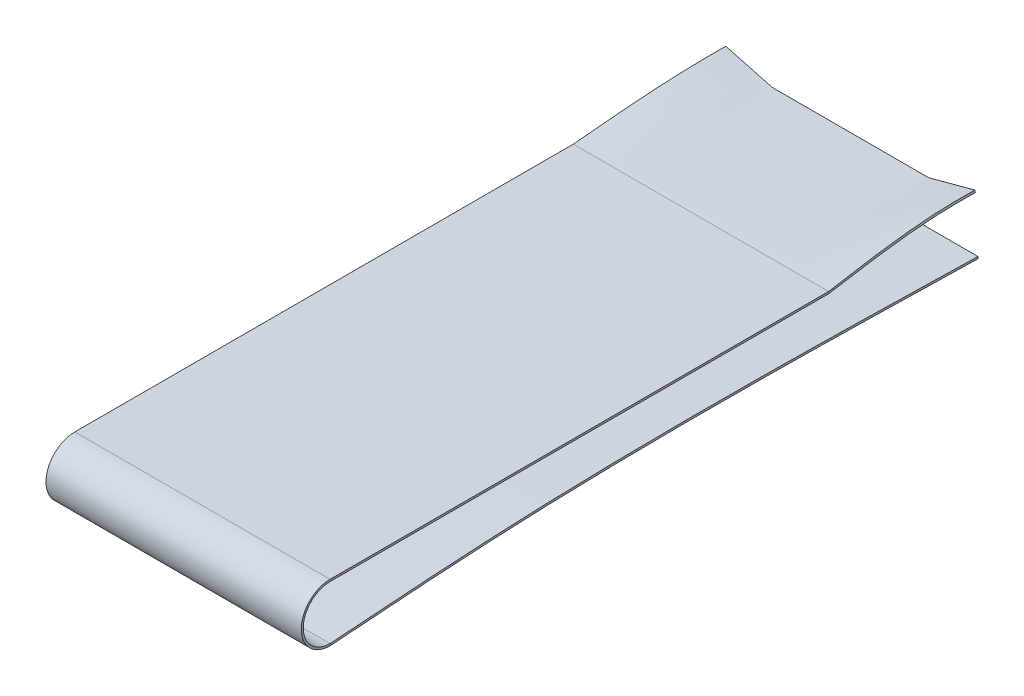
ISO-10303-21;
HEADER;
FILE_DESCRIPTION(('STEP AP214'),'2;1');
FILE_NAME('part.step','',(''),(''),'','','');
FILE_SCHEMA(('AUTOMOTIVE_DESIGN { 1 0 10303 214 1 1 1 1 }'));
ENDSEC;
DATA;
#1=APPLICATION_CONTEXT('core data for automotive mechanical design processes');
#2=APPLICATION_PROTOCOL_DEFINITION('international standard','automotive_design',2000,#1);
#3=PRODUCT_CONTEXT('',#1,'mechanical');
#4=PRODUCT('Part','Part','',(#3));
#5=PRODUCT_RELATED_PRODUCT_CATEGORY('part','',(#4));
#6=PRODUCT_DEFINITION_FORMATION('','',#4);
#7=PRODUCT_DEFINITION_CONTEXT('part definition',#1,'design');
#8=PRODUCT_DEFINITION('design','',#6,#7);
#9=PRODUCT_DEFINITION_SHAPE('','',#8);
#10=(LENGTH_UNIT() NAMED_UNIT(*) SI_UNIT(.MILLI.,.METRE.));
#11=(NAMED_UNIT(*) PLANE_ANGLE_UNIT() SI_UNIT($,.RADIAN.));
#12=(NAMED_UNIT(*) SI_UNIT($,.STERADIAN.) SOLID_ANGLE_UNIT());
#13=UNCERTAINTY_MEASURE_WITH_UNIT(LENGTH_MEASURE(1.E-05),#10,'distance_accuracy_value','');
#14=(GEOMETRIC_REPRESENTATION_CONTEXT(3) GLOBAL_UNCERTAINTY_ASSIGNED_CONTEXT((#13)) GLOBAL_UNIT_ASSIGNED_CONTEXT((#10,
#11,#12)) REPRESENTATION_CONTEXT('',''));
#15=CARTESIAN_POINT('',(0.,0.,0.));
#16=DIRECTION('',(0.,0.,1.));
#17=DIRECTION('',(1.,0.,0.));
#18=AXIS2_PLACEMENT_3D('',#15,#16,#17);
#19=CARTESIAN_POINT('',(640.,-243.675603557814,2500.));
#20=CARTESIAN_POINT('',(640.,-222.30441062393,2208.91527030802));
#21=CARTESIAN_POINT('',(640.,-142.935077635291,1127.8712260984));
#22=CARTESIAN_POINT('',(640.,-168.493221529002,43.4367961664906));
#23=CARTESIAN_POINT('',(640.,-187.169513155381,-749.));
#24=CARTESIAN_POINT('',(640.,-253.675603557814,2500.));
#25=CARTESIAN_POINT('',(640.062452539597,-232.303894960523,2208.91527030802));
#26=CARTESIAN_POINT('',(640.2943916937,-152.932646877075,1127.8712260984));
#27=CARTESIAN_POINT('',(640.219703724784,-178.49140746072,43.4367961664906));
#28=CARTESIAN_POINT('',(640.165126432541,-197.168149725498,-749.));
#29=B_SPLINE_SURFACE_WITH_KNOTS('',1,3,((#19,#20,#21,#22,#23),(#24,#25,#26,#27,#28)),
.UNSPECIFIED.,.F.,.F.,.F.,(2,2),(4,1,4),(0.,1.),(0.,0.269262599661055,1.),.UNSPECIFIED.);
#30=DIRECTION('',(0.,-1.,0.));
#31=VECTOR('',#30,1.);
#32=CARTESIAN_POINT('',(640.,-248.675603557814,2500.));
#33=LINE('',#32,#31);
#34=CARTESIAN_POINT('',(640.,-243.675603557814,2500.));
#35=VERTEX_POINT('',#34);
#36=CARTESIAN_POINT('',(640.,-253.675603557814,2500.));
#37=VERTEX_POINT('',#36);
#38=EDGE_CURVE('E13',#35,#37,#33,.T.);
#39=CARTESIAN_POINT('',(640.,-253.675603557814,2500.));
#40=CARTESIAN_POINT('',(640.062452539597,-232.303894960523,2208.91527030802));
#41=CARTESIAN_POINT('',(640.2943916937,-152.932646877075,1127.8712260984));
#42=CARTESIAN_POINT('',(640.219703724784,-178.49140746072,43.4367961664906));
#43=CARTESIAN_POINT('',(640.165126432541,-197.168149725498,-749.));
#44=B_SPLINE_CURVE_WITH_KNOTS('',3,(#39,#40,#41,#42,#43),.UNSPECIFIED.,.F.,.F.,(4,1,4),(0.,
0.269262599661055,1.),.UNSPECIFIED.);
#45=CARTESIAN_POINT('',(640.165126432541,-197.168149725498,-749.));
#46=VERTEX_POINT('',#45);
#47=EDGE_CURVE('E557',#37,#46,#44,.T.);
#48=DIRECTION('',(-0.0165126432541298,0.999863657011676,0.));
#49=VECTOR('',#48,1.);
#50=CARTESIAN_POINT('',(640.082563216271,-192.168831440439,-749.));
#51=LINE('',#50,#49);
#52=CARTESIAN_POINT('',(640.,-187.169513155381,-749.));
#53=VERTEX_POINT('',#52);
#54=EDGE_CURVE('E551',#46,#53,#51,.T.);
#55=CARTESIAN_POINT('',(640.,-243.675603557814,2500.));
#56=CARTESIAN_POINT('',(640.,-222.30441062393,2208.91527030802));
#57=CARTESIAN_POINT('',(640.,-142.935077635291,1127.8712260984));
#58=CARTESIAN_POINT('',(640.,-168.493221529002,43.4367961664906));
#59=CARTESIAN_POINT('',(640.,-187.169513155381,-749.));
#60=B_SPLINE_CURVE_WITH_KNOTS('',3,(#55,#56,#57,#58,#59),.UNSPECIFIED.,.F.,.F.,(4,1,4),(0.,
0.269262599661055,1.),.UNSPECIFIED.);
#61=EDGE_CURVE('E626',#53,#35,#60,.F.);
#62=ORIENTED_EDGE('',*,*,#38,.T.);
#63=ORIENTED_EDGE('',*,*,#47,.T.);
#64=ORIENTED_EDGE('',*,*,#54,.T.);
#65=ORIENTED_EDGE('',*,*,#61,.T.);
#66=EDGE_LOOP('',(#62,#63,#64,#65));
#67=FACE_BOUND('',#66,.T.);
#68=ADVANCED_FACE('F547',(#67),#29,.T.);
#69=CARTESIAN_POINT('',(640.,-253.675603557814,2500.));
#70=CARTESIAN_POINT('',(640.062452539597,-232.303894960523,2208.91527030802));
#71=CARTESIAN_POINT('',(640.2943916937,-152.932646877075,1127.8712260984));
#72=CARTESIAN_POINT('',(640.219703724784,-178.49140746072,43.4367961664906));
#73=CARTESIAN_POINT('',(640.165126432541,-197.168149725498,-749.));
#74=CARTESIAN_POINT('',(-640.,-253.675603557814,2500.));
#75=CARTESIAN_POINT('',(-640.,-232.303894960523,2208.91527030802));
#76=CARTESIAN_POINT('',(-640.,-152.932646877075,1127.8712260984));
#77=CARTESIAN_POINT('',(-640.,-178.49140746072,43.4367961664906));
#78=CARTESIAN_POINT('',(-640.,-197.168149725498,-749.));
#79=B_SPLINE_SURFACE_WITH_KNOTS('',1,3,((#69,#70,#71,#72,#73),(#74,#75,#76,#77,#78)),
.UNSPECIFIED.,.F.,.F.,.F.,(2,2),(4,1,4),(0.,1.),(0.,0.269262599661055,1.),.UNSPECIFIED.);
#80=DIRECTION('',(-1.,0.,0.));
#81=VECTOR('',#80,1.);
#82=CARTESIAN_POINT('',(0.,-253.675603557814,2500.));
#83=LINE('',#82,#81);
#84=CARTESIAN_POINT('',(-640.,-253.675603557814,2500.));
#85=VERTEX_POINT('',#84);
#86=EDGE_CURVE('E620',#37,#85,#83,.T.);
#87=CARTESIAN_POINT('',(-640.,-253.675603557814,2500.));
#88=CARTESIAN_POINT('',(-640.,-232.303894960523,2208.91527030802));
#89=CARTESIAN_POINT('',(-640.,-152.932646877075,1127.8712260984));
#90=CARTESIAN_POINT('',(-640.,-178.49140746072,43.4367961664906));
#91=CARTESIAN_POINT('',(-640.,-197.168149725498,-749.));
#92=B_SPLINE_CURVE_WITH_KNOTS('',3,(#87,#88,#89,#90,#91),.UNSPECIFIED.,.F.,.F.,(4,1,4),(0.,
0.269262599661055,1.),.UNSPECIFIED.);
#93=CARTESIAN_POINT('',(-640.,-197.168149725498,-749.));
#94=VERTEX_POINT('',#93);
#95=EDGE_CURVE('E592',#85,#94,#92,.T.);
#96=DIRECTION('',(1.,0.,0.));
#97=VECTOR('',#96,1.);
#98=CARTESIAN_POINT('',(0.082563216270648,-197.168149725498,-749.));
#99=LINE('',#98,#97);
#100=EDGE_CURVE('E601',#94,#46,#99,.T.);
#101=ORIENTED_EDGE('',*,*,#86,.T.);
#102=ORIENTED_EDGE('',*,*,#95,.T.);
#103=ORIENTED_EDGE('',*,*,#100,.T.);
#104=ORIENTED_EDGE('',*,*,#47,.F.);
#105=EDGE_LOOP('',(#101,#102,#103,#104));
#106=FACE_BOUND('',#105,.T.);
#107=ADVANCED_FACE('F661',(#106),#79,.T.);
#108=CARTESIAN_POINT('',(-640.,-243.675603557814,2500.));
#109=CARTESIAN_POINT('',(-640.,-222.30441062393,2208.91527030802));
#110=CARTESIAN_POINT('',(-640.,-142.935077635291,1127.8712260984));
#111=CARTESIAN_POINT('',(-640.,-168.493221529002,43.4367961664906));
#112=CARTESIAN_POINT('',(-640.,-187.169513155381,-749.));
#113=CARTESIAN_POINT('',(640.,-243.675603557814,2500.));
#114=CARTESIAN_POINT('',(640.,-222.30441062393,2208.91527030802));
#115=CARTESIAN_POINT('',(640.,-142.935077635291,1127.8712260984));
#116=CARTESIAN_POINT('',(640.,-168.493221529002,43.4367961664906));
#117=CARTESIAN_POINT('',(640.,-187.169513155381,-749.));
#118=B_SPLINE_SURFACE_WITH_KNOTS('',1,3,((#108,#109,#110,#111,#112),(#113,#114,#115,#116,#117)),
.UNSPECIFIED.,.F.,.F.,.F.,(2,2),(4,1,4),(0.,1.),(0.,0.269262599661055,1.),.UNSPECIFIED.);
#119=DIRECTION('',(1.,0.,0.));
#120=VECTOR('',#119,1.);
#121=CARTESIAN_POINT('',(0.,-243.675603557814,2500.));
#122=LINE('',#121,#120);
#123=CARTESIAN_POINT('',(-640.,-243.675603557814,2500.));
#124=VERTEX_POINT('',#123);
#125=EDGE_CURVE('E597',#124,#35,#122,.T.);
#126=DIRECTION('',(-1.,0.,0.));
#127=VECTOR('',#126,1.);
#128=CARTESIAN_POINT('',(0.,-187.169513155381,-749.));
#129=LINE('',#128,#127);
#130=CARTESIAN_POINT('',(-640.,-187.169513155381,-749.));
#131=VERTEX_POINT('',#130);
#132=EDGE_CURVE('E594',#53,#131,#129,.T.);
#133=CARTESIAN_POINT('',(-640.,-243.675603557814,2500.));
#134=CARTESIAN_POINT('',(-640.,-222.30441062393,2208.91527030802));
#135=CARTESIAN_POINT('',(-640.,-142.935077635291,1127.8712260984));
#136=CARTESIAN_POINT('',(-640.,-168.493221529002,43.4367961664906));
#137=CARTESIAN_POINT('',(-640.,-187.169513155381,-749.));
#138=B_SPLINE_CURVE_WITH_KNOTS('',3,(#133,#134,#135,#136,#137),.UNSPECIFIED.,.F.,.F.,(4,1,4),
(0.,0.269262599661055,1.),.UNSPECIFIED.);
#139=EDGE_CURVE('E590',#124,#131,#138,.T.);
#140=ORIENTED_EDGE('',*,*,#125,.T.);
#141=ORIENTED_EDGE('',*,*,#61,.F.);
#142=ORIENTED_EDGE('',*,*,#132,.T.);
#143=ORIENTED_EDGE('',*,*,#139,.F.);
#144=EDGE_LOOP('',(#140,#141,#142,#143));
#145=FACE_BOUND('',#144,.T.);
#146=ADVANCED_FACE('F603',(#145),#118,.T.);
#147=CARTESIAN_POINT('',(-640.,-253.675603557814,2500.));
#148=DIRECTION('',(-1.,0.,0.));
#149=DIRECTION('',(0.,1.,0.));
#150=AXIS2_PLACEMENT_3D('',#147,#148,#149);
#151=PLANE('',#150);
#152=DIRECTION('',(0.,1.,0.));
#153=VECTOR('',#152,1.);
#154=CARTESIAN_POINT('',(-640.,-248.675603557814,2500.));
#155=LINE('',#154,#153);
#156=EDGE_CURVE('E585',#85,#124,#155,.T.);
#157=ORIENTED_EDGE('',*,*,#156,.T.);
#158=ORIENTED_EDGE('',*,*,#139,.T.);
#159=DIRECTION('',(0.,-1.,0.));
#160=VECTOR('',#159,1.);
#161=CARTESIAN_POINT('',(-640.,-192.168831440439,-749.));
#162=LINE('',#161,#160);
#163=EDGE_CURVE('E605',#131,#94,#162,.T.);
#164=ORIENTED_EDGE('',*,*,#163,.T.);
#165=ORIENTED_EDGE('',*,*,#95,.F.);
#166=EDGE_LOOP('',(#157,#158,#164,#165));
#167=FACE_BOUND('',#166,.T.);
#168=ADVANCED_FACE('F587',(#167),#151,.T.);
#169=OPEN_SHELL('',(#68,#107,#146,#168));
#170=SHELL_BASED_SURFACE_MODEL('B2',(#169));
#171=CARTESIAN_POINT('',(640.,25.3243964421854,0.));
#172=CARTESIAN_POINT('',(633.862811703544,52.9508621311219,-207.881763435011));
#173=CARTESIAN_POINT('',(626.497893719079,86.1039355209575,-457.349771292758));
#174=CARTESIAN_POINT('',(626.931215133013,84.15334534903,-707.328601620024));
#175=CARTESIAN_POINT('',(627.003449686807,83.8281825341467,-749.));
#176=CARTESIAN_POINT('',(561.092534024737,25.3243964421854,0.));
#177=CARTESIAN_POINT('',(556.500032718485,43.3805911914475,-207.881763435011));
#178=CARTESIAN_POINT('',(550.988812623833,65.0488840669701,-457.349771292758));
#179=CARTESIAN_POINT('',(551.313070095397,63.7740110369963,-707.328601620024));
#180=CARTESIAN_POINT('',(551.367123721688,63.5614900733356,-749.000000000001));
#181=CARTESIAN_POINT('',(482.177140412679,25.3243964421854,0.));
#182=CARTESIAN_POINT('',(479.134860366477,33.8108000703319,-207.881763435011));
#183=CARTESIAN_POINT('',(475.483979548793,43.9948882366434,-457.349771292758));
#184=CARTESIAN_POINT('',(475.698782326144,43.3956984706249,-707.328601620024));
#185=CARTESIAN_POINT('',(475.734589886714,43.2958137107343,-749.));
#186=CARTESIAN_POINT('',(400.625946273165,25.3243964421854,0.));
#187=CARTESIAN_POINT('',(399.174545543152,23.9183951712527,-207.881763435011));
#188=CARTESIAN_POINT('',(397.432795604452,22.2311267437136,-457.349771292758));
#189=CARTESIAN_POINT('',(397.53527299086,22.3303986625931,-707.328601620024));
#190=CARTESIAN_POINT('',(397.552355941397,22.3469472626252,-749.));
#191=CARTESIAN_POINT('',(396.248180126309,25.3243964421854,0.));
#192=CARTESIAN_POINT('',(394.830071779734,23.5423915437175,-207.881763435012));
#193=CARTESIAN_POINT('',(393.128274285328,21.4039008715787,-457.34977129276));
#194=CARTESIAN_POINT('',(393.228401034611,21.5297208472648,-707.328601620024));
#195=CARTESIAN_POINT('',(393.245092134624,21.5506950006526,-749.));
#196=CARTESIAN_POINT('',(391.865238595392,25.3243964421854,0.));
#197=CARTESIAN_POINT('',(390.456065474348,23.4355295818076,-207.881763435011));
#198=CARTESIAN_POINT('',(388.764990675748,21.1687994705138,-457.349771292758));
#199=CARTESIAN_POINT('',(388.86448654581,21.3021645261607,-707.328601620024));
#200=CARTESIAN_POINT('',(388.881072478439,21.3243964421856,-749.));
#201=CARTESIAN_POINT('',(130.244393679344,25.3243964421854,0.));
#202=CARTESIAN_POINT('',(129.773453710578,23.4355295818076,-207.881763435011));
#203=CARTESIAN_POINT('',(129.2083033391,21.1687994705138,-457.349771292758));
#204=CARTESIAN_POINT('',(129.241554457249,21.3021645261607,-707.328601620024));
#205=CARTESIAN_POINT('',(129.247097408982,21.3243964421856,-749.000000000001));
#206=CARTESIAN_POINT('',(-129.660375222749,25.3243964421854,0.));
#207=CARTESIAN_POINT('',(-129.181888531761,23.4355295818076,-207.881763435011));
#208=CARTESIAN_POINT('',(-128.607681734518,21.1687994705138,-457.349771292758));
#209=CARTESIAN_POINT('',(-128.641465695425,21.3021645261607,-707.328601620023));
#210=CARTESIAN_POINT('',(-128.647097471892,21.3243964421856,-749.));
#211=CARTESIAN_POINT('',(-391.976531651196,25.3243964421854,0.));
#212=CARTESIAN_POINT('',(-390.557316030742,23.4355295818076,-207.881763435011));
#213=CARTESIAN_POINT('',(-388.854189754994,21.1687994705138,-457.349771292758));
#214=CARTESIAN_POINT('',(-388.954394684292,21.3021645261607,-707.328601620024));
#215=CARTESIAN_POINT('',(-388.971098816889,21.3243964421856,-749.));
#216=CARTESIAN_POINT('',(-396.355614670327,25.3243964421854,0.));
#217=CARTESIAN_POINT('',(-394.9301998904,23.5853676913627,-207.881763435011));
#218=CARTESIAN_POINT('',(-393.219634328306,21.4984504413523,-457.349771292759));
#219=CARTESIAN_POINT('',(-393.320276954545,21.6212360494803,-707.328601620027));
#220=CARTESIAN_POINT('',(-393.337054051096,21.6417043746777,-749.000000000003));
#221=CARTESIAN_POINT('',(-400.73719116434,25.3243964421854,0.));
#222=CARTESIAN_POINT('',(-399.264678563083,24.0027321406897,-207.881763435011));
#223=CARTESIAN_POINT('',(-397.497593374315,22.4166720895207,-457.349771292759));
#224=CARTESIAN_POINT('',(-397.601561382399,22.5099893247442,-707.328601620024));
#225=CARTESIAN_POINT('',(-397.618892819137,22.5255452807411,-749.));
#226=CARTESIAN_POINT('',(-481.787793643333,25.3243964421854,0.));
#227=CARTESIAN_POINT('',(-478.73308986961,33.8341251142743,-207.881763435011));
#228=CARTESIAN_POINT('',(-475.067299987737,44.0462044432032,-457.349771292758));
#229=CARTESIAN_POINT('',(-475.282979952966,43.445367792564,-707.328601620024));
#230=CARTESIAN_POINT('',(-475.318933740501,43.3452084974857,-749.));
#231=CARTESIAN_POINT('',(-560.897861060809,25.3243964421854,0.));
#232=CARTESIAN_POINT('',(-556.2909153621,43.4280068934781,-207.881763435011));
#233=CARTESIAN_POINT('',(-550.762361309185,65.153200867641,-457.349771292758));
#234=CARTESIAN_POINT('',(-551.087638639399,63.8749800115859,-707.328601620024));
#235=CARTESIAN_POINT('',(-551.141862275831,63.6619009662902,-749.));
#236=CARTESIAN_POINT('',(-640.,25.3243964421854,0.));
#237=CARTESIAN_POINT('',(-633.843832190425,53.0216946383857,-207.881763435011));
#238=CARTESIAN_POINT('',(-626.456137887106,86.2597704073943,-457.349771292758));
#239=CARTESIAN_POINT('',(-626.890799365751,84.30417904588,-707.328601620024));
#240=CARTESIAN_POINT('',(-626.963257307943,83.9781825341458,-749.));
#241=B_SPLINE_SURFACE_WITH_KNOTS('',3,3,((#171,#172,#173,#174,#175),(#176,#177,#178,#179,#180),
(#181,#182,#183,#184,#185),(#186,#187,#188,#189,#190),(#191,#192,#193,#194,#195),(#196,#197,
#198,#199,#200),(#201,#202,#203,#204,#205),(#206,#207,#208,#209,#210),(#211,#212,#213,#214,
#215),(#216,#217,#218,#219,#220),(#221,#222,#223,#224,#225),(#226,#227,#228,#229,#230),(#231,
#232,#233,#234,#235),(#236,#237,#238,#239,#240)),.UNSPECIFIED.,.F.,.F.,.F.,(4,2,1,2,2,1,2,4),(4,
1,4),(0.,0.184932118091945,0.191147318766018,0.195227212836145,0.804316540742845,
0.810026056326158,0.814611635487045,1.),(0.,0.83330029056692,1.),.UNSPECIFIED.);
#242=DIRECTION('',(-1.,0.,0.));
#243=VECTOR('',#242,1.);
#244=CARTESIAN_POINT('',(-4.69342560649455E-06,25.3243964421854,0.));
#245=LINE('',#244,#243);
#246=CARTESIAN_POINT('',(640.,25.3243964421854,0.));
#247=VERTEX_POINT('',#246);
#248=CARTESIAN_POINT('',(-640.,25.3243964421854,0.));
#249=VERTEX_POINT('',#248);
#250=EDGE_CURVE('E545',#247,#249,#245,.T.);
#251=CARTESIAN_POINT('',(-640.,25.3243964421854,0.));
#252=CARTESIAN_POINT('',(-633.843832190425,53.0216946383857,-207.881763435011));
#253=CARTESIAN_POINT('',(-626.456137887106,86.2597704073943,-457.349771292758));
#254=CARTESIAN_POINT('',(-626.890799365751,84.30417904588,-707.328601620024));
#255=CARTESIAN_POINT('',(-626.963257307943,83.9781825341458,-749.));
#256=B_SPLINE_CURVE_WITH_KNOTS('',3,(#251,#252,#253,#254,#255),.UNSPECIFIED.,.F.,.F.,(4,1,4),
(0.,0.83330029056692,1.),.UNSPECIFIED.);
#257=CARTESIAN_POINT('',(-626.963257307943,83.9781825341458,-749.));
#258=VERTEX_POINT('',#257);
#259=EDGE_CURVE('E731',#249,#258,#256,.T.);
#260=CARTESIAN_POINT('',(627.003449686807,83.8281825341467,-749.));
#261=CARTESIAN_POINT('',(551.367123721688,63.5614900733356,-749.000000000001));
#262=CARTESIAN_POINT('',(475.734589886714,43.2958137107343,-749.));
#263=CARTESIAN_POINT('',(397.552355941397,22.3469472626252,-749.));
#264=CARTESIAN_POINT('',(393.245092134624,21.5506950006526,-749.));
#265=CARTESIAN_POINT('',(388.881072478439,21.3243964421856,-749.));
#266=CARTESIAN_POINT('',(129.247097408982,21.3243964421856,-749.000000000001));
#267=CARTESIAN_POINT('',(-128.647097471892,21.3243964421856,-749.));
#268=CARTESIAN_POINT('',(-388.971098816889,21.3243964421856,-749.));
#269=CARTESIAN_POINT('',(-393.337054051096,21.6417043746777,-749.000000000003));
#270=CARTESIAN_POINT('',(-397.618892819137,22.5255452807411,-749.));
#271=CARTESIAN_POINT('',(-475.318933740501,43.3452084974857,-749.));
#272=CARTESIAN_POINT('',(-551.141862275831,63.6619009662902,-749.));
#273=CARTESIAN_POINT('',(-626.963257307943,83.9781825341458,-749.));
#274=B_SPLINE_CURVE_WITH_KNOTS('',3,(#260,#261,#262,#263,#264,#265,#266,#267,#268,#269,#270,
#271,#272,#273),.UNSPECIFIED.,.F.,.F.,(4,2,1,2,2,1,2,4),(0.,0.184932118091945,0.191147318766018,
0.195227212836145,0.804316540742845,0.810026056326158,0.814611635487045,1.),.UNSPECIFIED.);
#275=CARTESIAN_POINT('',(627.003449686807,83.8281825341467,-749.));
#276=VERTEX_POINT('',#275);
#277=EDGE_CURVE('E738',#258,#276,#274,.F.);
#278=CARTESIAN_POINT('',(640.,25.3243964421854,0.));
#279=CARTESIAN_POINT('',(633.862811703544,52.9508621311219,-207.881763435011));
#280=CARTESIAN_POINT('',(626.497893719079,86.1039355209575,-457.349771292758));
#281=CARTESIAN_POINT('',(626.931215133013,84.15334534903,-707.328601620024));
#282=CARTESIAN_POINT('',(627.003449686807,83.8281825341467,-749.));
#283=B_SPLINE_CURVE_WITH_KNOTS('',3,(#278,#279,#280,#281,#282),.UNSPECIFIED.,.F.,.F.,(4,1,4),
(0.,0.83330029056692,1.),.UNSPECIFIED.);
#284=EDGE_CURVE('E806',#276,#247,#283,.F.);
#285=ORIENTED_EDGE('',*,*,#250,.T.);
#286=ORIENTED_EDGE('',*,*,#259,.T.);
#287=ORIENTED_EDGE('',*,*,#277,.T.);
#288=ORIENTED_EDGE('',*,*,#284,.T.);
#289=EDGE_LOOP('',(#285,#286,#287,#288));
#290=FACE_BOUND('',#289,.T.);
#291=ADVANCED_FACE('F722',(#290),#241,.T.);
#292=CARTESIAN_POINT('',(-640.,25.3243964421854,0.));
#293=CARTESIAN_POINT('',(-633.843832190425,53.0216946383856,-207.881763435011));
#294=CARTESIAN_POINT('',(-626.456137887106,86.2597704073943,-457.349771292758));
#295=CARTESIAN_POINT('',(-626.890799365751,84.3041790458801,-707.328601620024));
#296=CARTESIAN_POINT('',(-626.963257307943,83.9781825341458,-749.));
#297=CARTESIAN_POINT('',(-640.,35.3243964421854,0.));
#298=CARTESIAN_POINT('',(-632.621645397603,62.8607906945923,-207.881763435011));
#299=CARTESIAN_POINT('',(-623.767268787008,95.9057740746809,-457.349771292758));
#300=CARTESIAN_POINT('',(-624.288223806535,93.9615434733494,-707.328601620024));
#301=CARTESIAN_POINT('',(-624.375066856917,93.6374407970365,-749.));
#302=B_SPLINE_SURFACE_WITH_KNOTS('',1,3,((#292,#293,#294,#295,#296),(#297,#298,#299,#300,#301)),
.UNSPECIFIED.,.F.,.F.,.F.,(2,2),(4,1,4),(0.,1.),(0.,0.83330029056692,1.),.UNSPECIFIED.);
#303=DIRECTION('',(0.,1.,0.));
#304=VECTOR('',#303,1.);
#305=CARTESIAN_POINT('',(-640.,30.3243964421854,0.));
#306=LINE('',#305,#304);
#307=CARTESIAN_POINT('',(-640.,35.3243964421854,0.));
#308=VERTEX_POINT('',#307);
#309=EDGE_CURVE('E800',#249,#308,#306,.T.);
#310=CARTESIAN_POINT('',(-640.,35.3243964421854,0.));
#311=CARTESIAN_POINT('',(-632.621645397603,62.8607906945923,-207.881763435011));
#312=CARTESIAN_POINT('',(-623.767268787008,95.9057740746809,-457.349771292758));
#313=CARTESIAN_POINT('',(-624.288223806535,93.9615434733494,-707.328601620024));
#314=CARTESIAN_POINT('',(-624.375066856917,93.6374407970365,-749.));
#315=B_SPLINE_CURVE_WITH_KNOTS('',3,(#310,#311,#312,#313,#314),.UNSPECIFIED.,.F.,.F.,(4,1,4),
(0.,0.83330029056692,1.),.UNSPECIFIED.);
#316=CARTESIAN_POINT('',(-624.375066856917,93.6374407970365,-749.));
#317=VERTEX_POINT('',#316);
#318=EDGE_CURVE('E767',#308,#317,#315,.T.);
#319=DIRECTION('',(-0.258819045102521,-0.965925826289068,0.));
#320=VECTOR('',#319,1.);
#321=CARTESIAN_POINT('',(-625.66916208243,88.8078116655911,-749.));
#322=LINE('',#321,#320);
#323=EDGE_CURVE('E776',#317,#258,#322,.T.);
#324=ORIENTED_EDGE('',*,*,#309,.T.);
#325=ORIENTED_EDGE('',*,*,#318,.T.);
#326=ORIENTED_EDGE('',*,*,#323,.T.);
#327=ORIENTED_EDGE('',*,*,#259,.F.);
#328=EDGE_LOOP('',(#324,#325,#326,#327));
#329=FACE_BOUND('',#328,.T.);
#330=ADVANCED_FACE('F830',(#329),#302,.T.);
#331=CARTESIAN_POINT('',(640.,35.3243964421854,0.));
#332=CARTESIAN_POINT('',(632.640624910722,62.7899581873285,-207.881763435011));
#333=CARTESIAN_POINT('',(623.809024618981,95.7499391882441,-457.349771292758));
#334=CARTESIAN_POINT('',(624.328639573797,93.8107097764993,-707.328601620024));
#335=CARTESIAN_POINT('',(624.415259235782,93.4874407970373,-749.));
#336=CARTESIAN_POINT('',(640.,25.3243964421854,0.));
#337=CARTESIAN_POINT('',(633.862811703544,52.9508621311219,-207.881763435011));
#338=CARTESIAN_POINT('',(626.497893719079,86.1039355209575,-457.349771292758));
#339=CARTESIAN_POINT('',(626.931215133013,84.15334534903,-707.328601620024));
#340=CARTESIAN_POINT('',(627.003449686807,83.8281825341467,-749.));
#341=B_SPLINE_SURFACE_WITH_KNOTS('',1,3,((#331,#332,#333,#334,#335),(#336,#337,#338,#339,#340)),
.UNSPECIFIED.,.F.,.F.,.F.,(2,2),(4,1,4),(0.,1.),(0.,0.83330029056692,1.),.UNSPECIFIED.);
#342=DIRECTION('',(0.,-1.,0.));
#343=VECTOR('',#342,1.);
#344=CARTESIAN_POINT('',(640.,30.3243964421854,0.));
#345=LINE('',#344,#343);
#346=CARTESIAN_POINT('',(640.,35.3243964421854,0.));
#347=VERTEX_POINT('',#346);
#348=EDGE_CURVE('E772',#347,#247,#345,.T.);
#349=DIRECTION('',(-0.258819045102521,0.965925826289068,0.));
#350=VECTOR('',#349,1.);
#351=CARTESIAN_POINT('',(625.709354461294,88.657811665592,-749.));
#352=LINE('',#351,#350);
#353=CARTESIAN_POINT('',(624.415259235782,93.4874407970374,-749.));
#354=VERTEX_POINT('',#353);
#355=EDGE_CURVE('E769',#276,#354,#352,.T.);
#356=CARTESIAN_POINT('',(640.,35.3243964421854,0.));
#357=CARTESIAN_POINT('',(632.640624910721,62.7899581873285,-207.881763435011));
#358=CARTESIAN_POINT('',(623.809024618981,95.7499391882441,-457.349771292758));
#359=CARTESIAN_POINT('',(624.328639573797,93.8107097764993,-707.328601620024));
#360=CARTESIAN_POINT('',(624.415259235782,93.4874407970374,-749.));
#361=B_SPLINE_CURVE_WITH_KNOTS('',3,(#356,#357,#358,#359,#360),.UNSPECIFIED.,.F.,.F.,(4,1,4),
(0.,0.83330029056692,1.),.UNSPECIFIED.);
#362=EDGE_CURVE('E765',#347,#354,#361,.T.);
#363=ORIENTED_EDGE('',*,*,#348,.T.);
#364=ORIENTED_EDGE('',*,*,#284,.F.);
#365=ORIENTED_EDGE('',*,*,#355,.T.);
#366=ORIENTED_EDGE('',*,*,#362,.F.);
#367=EDGE_LOOP('',(#363,#364,#365,#366));
#368=FACE_BOUND('',#367,.T.);
#369=ADVANCED_FACE('F778',(#368),#341,.T.);
#370=CARTESIAN_POINT('',(-640.,35.3243964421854,0.));
#371=CARTESIAN_POINT('',(-632.621645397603,62.8607906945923,-207.881763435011));
#372=CARTESIAN_POINT('',(-623.767268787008,95.9057740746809,-457.349771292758));
#373=CARTESIAN_POINT('',(-624.288223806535,93.9615434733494,-707.328601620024));
#374=CARTESIAN_POINT('',(-624.375066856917,93.6374407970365,-749.));
#375=CARTESIAN_POINT('',(-561.012614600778,35.3243964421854,0.));
#376=CARTESIAN_POINT('',(-555.329806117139,53.3208301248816,-207.881763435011));
#377=CARTESIAN_POINT('',(-548.510165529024,74.9174068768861,-457.349771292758));
#378=CARTESIAN_POINT('',(-548.911405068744,73.6467533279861,-707.328601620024));
#379=CARTESIAN_POINT('',(-548.978291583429,73.4349357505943,-749.));
#380=CARTESIAN_POINT('',(-482.017280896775,35.3243964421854,0.));
#381=CARTESIAN_POINT('',(-478.032702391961,43.780582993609,-207.881763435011));
#382=CARTESIAN_POINT('',(-473.25101858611,53.9284092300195,-457.349771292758));
#383=CARTESIAN_POINT('',(-473.532353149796,53.3313529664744,-707.328601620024));
#384=CARTESIAN_POINT('',(-473.579251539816,53.2318238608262,-749.));
#385=CARTESIAN_POINT('',(-400.375157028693,35.3243964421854,0.));
#386=CARTESIAN_POINT('',(-398.137171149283,33.9183960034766,-207.881763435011));
#387=CARTESIAN_POINT('',(-395.451481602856,32.2311285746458,-457.349771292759));
#388=CARTESIAN_POINT('',(-395.609496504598,32.3304004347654,-707.328601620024));
#389=CARTESIAN_POINT('',(-395.635837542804,32.3469490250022,-749.));
#390=CARTESIAN_POINT('',(-395.979156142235,35.3243964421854,0.));
#391=CARTESIAN_POINT('',(-393.783069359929,33.5423912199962,-207.881763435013));
#392=CARTESIAN_POINT('',(-391.14766072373,31.4039001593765,-457.349771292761));
#393=CARTESIAN_POINT('',(-391.302717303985,31.5297201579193,-707.328601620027));
#394=CARTESIAN_POINT('',(-391.32856519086,31.5506943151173,-749.000000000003));
#395=CARTESIAN_POINT('',(-391.577965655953,35.3243964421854,0.));
#396=CARTESIAN_POINT('',(-389.399430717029,33.4355295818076,-207.881763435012));
#397=CARTESIAN_POINT('',(-386.785085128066,31.1687994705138,-457.349771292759));
#398=CARTESIAN_POINT('',(-386.93890244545,31.3021645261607,-707.328601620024));
#399=CARTESIAN_POINT('',(-386.964543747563,31.3243964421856,-749.));
#400=CARTESIAN_POINT('',(-129.756088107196,35.3243964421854,0.));
#401=CARTESIAN_POINT('',(-129.025170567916,33.4355295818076,-207.881763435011));
#402=CARTESIAN_POINT('',(-128.148034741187,31.1687994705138,-457.349771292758));
#403=CARTESIAN_POINT('',(-128.19964179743,31.3021645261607,-707.328601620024));
#404=CARTESIAN_POINT('',(-128.208244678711,31.3243964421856,-749.000000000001));
#405=CARTESIAN_POINT('',(130.342537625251,35.3243964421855,0.));
#406=CARTESIAN_POINT('',(129.618018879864,33.4355295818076,-207.88176343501));
#407=CARTESIAN_POINT('',(128.748561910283,31.1687994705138,-457.349771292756));
#408=CARTESIAN_POINT('',(128.799717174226,31.3021645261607,-707.328601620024));
#409=CARTESIAN_POINT('',(128.808244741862,31.3243964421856,-749.));
#410=CARTESIAN_POINT('',(392.862618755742,35.3243964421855,0.));
#411=CARTESIAN_POINT('',(390.686620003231,33.4355295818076,-207.881763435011));
#412=CARTESIAN_POINT('',(388.075317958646,31.1687994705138,-457.349771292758));
#413=CARTESIAN_POINT('',(388.228956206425,31.3021645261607,-707.328601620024));
#414=CARTESIAN_POINT('',(388.254567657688,31.3243964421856,-749.));
#415=CARTESIAN_POINT('',(397.259941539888,35.3243964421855,0.));
#416=CARTESIAN_POINT('',(395.069133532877,33.5853674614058,-207.881763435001));
#417=CARTESIAN_POINT('',(392.440059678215,31.4984499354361,-457.349771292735));
#418=CARTESIAN_POINT('',(392.594743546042,31.6212355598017,-707.328601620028));
#419=CARTESIAN_POINT('',(392.620529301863,31.641703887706,-749.000000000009));
#420=CARTESIAN_POINT('',(401.659762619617,35.3243964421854,0.));
#421=CARTESIAN_POINT('',(399.413243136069,34.0027326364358,-207.881763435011));
#422=CARTESIAN_POINT('',(396.717312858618,32.4166731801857,-457.349771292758));
#423=CARTESIAN_POINT('',(396.875930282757,32.5099903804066,-707.328601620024));
#424=CARTESIAN_POINT('',(396.902371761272,32.5255463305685,-749.));
#425=CARTESIAN_POINT('',(482.408248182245,35.3243964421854,0.));
#426=CARTESIAN_POINT('',(478.432345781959,43.756458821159,-207.881763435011));
#427=CARTESIAN_POINT('',(473.661073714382,53.8753349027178,-457.349771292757));
#428=CARTESIAN_POINT('',(473.946590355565,53.2812666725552,-707.328601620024));
#429=CARTESIAN_POINT('',(473.994185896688,53.1822356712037,-749.000000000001));
#430=CARTESIAN_POINT('',(561.208097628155,35.3243964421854,0.));
#431=CARTESIAN_POINT('',(555.540798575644,53.2738022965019,-207.881763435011));
#432=CARTESIAN_POINT('',(548.739770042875,74.8139434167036,-457.349771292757));
#433=CARTESIAN_POINT('',(549.136660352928,73.5457383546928,-707.328601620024));
#434=CARTESIAN_POINT('',(549.202821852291,73.334328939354,-749.));
#435=CARTESIAN_POINT('',(640.,35.3243964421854,0.));
#436=CARTESIAN_POINT('',(632.640624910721,62.7899581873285,-207.881763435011));
#437=CARTESIAN_POINT('',(623.809024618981,95.7499391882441,-457.349771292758));
#438=CARTESIAN_POINT('',(624.328639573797,93.8107097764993,-707.328601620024));
#439=CARTESIAN_POINT('',(624.415259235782,93.4874407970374,-749.));
#440=B_SPLINE_SURFACE_WITH_KNOTS('',3,3,((#370,#371,#372,#373,#374),(#375,#376,#377,#378,#379),
(#380,#381,#382,#383,#384),(#385,#386,#387,#388,#389),(#390,#391,#392,#393,#394),(#395,#396,
#397,#398,#399),(#400,#401,#402,#403,#404),(#405,#406,#407,#408,#409),(#410,#411,#412,#413,
#414),(#415,#416,#417,#418,#419),(#420,#421,#422,#423,#424),(#425,#426,#427,#428,#429),(#430,
#431,#432,#433,#434),(#435,#436,#437,#438,#439)),.UNSPECIFIED.,.F.,.F.,.F.,(4,2,1,2,2,1,2,4),(4,
1,4),(0.,0.185119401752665,0.191360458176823,0.195457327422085,0.805000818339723,
0.810734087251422,0.815338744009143,1.),(0.,0.83330029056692,1.),.UNSPECIFIED.);
#441=DIRECTION('',(1.,0.,0.));
#442=VECTOR('',#441,1.);
#443=CARTESIAN_POINT('',(-4.58104755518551E-06,35.3243964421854,0.));
#444=LINE('',#443,#442);
#445=EDGE_CURVE('E760',#308,#347,#444,.T.);
#446=CARTESIAN_POINT('',(-624.375066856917,93.6374407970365,-749.));
#447=CARTESIAN_POINT('',(-548.978291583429,73.4349357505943,-749.));
#448=CARTESIAN_POINT('',(-473.579251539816,53.2318238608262,-749.));
#449=CARTESIAN_POINT('',(-395.635837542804,32.3469490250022,-749.));
#450=CARTESIAN_POINT('',(-391.32856519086,31.5506943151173,-749.000000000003));
#451=CARTESIAN_POINT('',(-386.964543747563,31.3243964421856,-749.));
#452=CARTESIAN_POINT('',(-128.208244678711,31.3243964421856,-749.000000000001));
#453=CARTESIAN_POINT('',(128.808244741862,31.3243964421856,-749.));
#454=CARTESIAN_POINT('',(388.254567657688,31.3243964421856,-749.));
#455=CARTESIAN_POINT('',(392.620529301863,31.641703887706,-749.000000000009));
#456=CARTESIAN_POINT('',(396.902371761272,32.5255463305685,-749.));
#457=CARTESIAN_POINT('',(473.994185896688,53.1822356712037,-749.000000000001));
#458=CARTESIAN_POINT('',(549.202821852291,73.334328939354,-749.));
#459=CARTESIAN_POINT('',(624.415259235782,93.4874407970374,-749.));
#460=B_SPLINE_CURVE_WITH_KNOTS('',3,(#446,#447,#448,#449,#450,#451,#452,#453,#454,#455,#456,
#457,#458,#459),.UNSPECIFIED.,.F.,.F.,(4,2,1,2,2,1,2,4),(0.,0.185119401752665,0.191360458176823,
0.195457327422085,0.805000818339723,0.810734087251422,0.815338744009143,1.),.UNSPECIFIED.);
#461=EDGE_CURVE('E780',#354,#317,#460,.F.);
#462=ORIENTED_EDGE('',*,*,#445,.T.);
#463=ORIENTED_EDGE('',*,*,#362,.T.);
#464=ORIENTED_EDGE('',*,*,#461,.T.);
#465=ORIENTED_EDGE('',*,*,#318,.F.);
#466=EDGE_LOOP('',(#462,#463,#464,#465));
#467=FACE_BOUND('',#466,.T.);
#468=ADVANCED_FACE('F762',(#467),#440,.T.);
#469=OPEN_SHELL('',(#291,#330,#369,#468));
#470=SHELL_BASED_SURFACE_MODEL('B7',(#469));
#471=CARTESIAN_POINT('',(-640.,35.3243964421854,2500.));
#472=DIRECTION('',(1.,0.,0.));
#473=DIRECTION('',(0.,0.,-1.));
#474=AXIS2_PLACEMENT_3D('',#471,#472,#473);
#475=PLANE('',#474);
#476=DIRECTION('',(0.,-1.,0.));
#477=VECTOR('',#476,1.);
#478=CARTESIAN_POINT('',(-640.,35.3243964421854,0.));
#479=LINE('',#478,#477);
#480=CARTESIAN_POINT('',(-640.,35.3243964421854,0.));
#481=VERTEX_POINT('',#480);
#482=CARTESIAN_POINT('',(-640.,25.3243964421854,0.));
#483=VERTEX_POINT('',#482);
#484=EDGE_CURVE('E989',#481,#483,#479,.T.);
#485=ORIENTED_EDGE('',*,*,#484,.T.);
#486=DIRECTION('',(0.,0.,-1.));
#487=VECTOR('',#486,1.);
#488=CARTESIAN_POINT('',(-640.,25.3243964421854,2500.));
#489=LINE('',#488,#487);
#490=CARTESIAN_POINT('',(-640.,25.3243964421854,2500.));
#491=VERTEX_POINT('',#490);
#492=EDGE_CURVE('E720',#491,#483,#489,.T.);
#493=ORIENTED_EDGE('',*,*,#492,.F.);
#494=CARTESIAN_POINT('',(-640.,-109.175603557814,2500.));
#495=DIRECTION('',(-1.,0.,0.));
#496=DIRECTION('',(0.,0.,1.));
#497=AXIS2_PLACEMENT_3D('',#494,#495,#496);
#498=CIRCLE('',#497,134.5);
#499=CARTESIAN_POINT('',(-640.,-243.675603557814,2500.));
#500=VERTEX_POINT('',#499);
#501=EDGE_CURVE('E979',#500,#491,#498,.T.);
#502=ORIENTED_EDGE('',*,*,#501,.F.);
#503=DIRECTION('',(0.,1.,0.));
#504=VECTOR('',#503,1.);
#505=CARTESIAN_POINT('',(-640.,-253.675603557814,2500.));
#506=LINE('',#505,#504);
#507=CARTESIAN_POINT('',(-640.,-253.675603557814,2500.));
#508=VERTEX_POINT('',#507);
#509=EDGE_CURVE('E1006',#508,#500,#506,.T.);
#510=ORIENTED_EDGE('',*,*,#509,.F.);
#511=CARTESIAN_POINT('',(-640.,-109.175603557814,2500.));
#512=DIRECTION('',(-1.,0.,0.));
#513=DIRECTION('',(0.,0.,1.));
#514=AXIS2_PLACEMENT_3D('',#511,#512,#513);
#515=CIRCLE('',#514,144.5);
#516=CARTESIAN_POINT('',(-640.,35.3243964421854,2500.));
#517=VERTEX_POINT('',#516);
#518=EDGE_CURVE('E987',#508,#517,#515,.T.);
#519=ORIENTED_EDGE('',*,*,#518,.T.);
#520=DIRECTION('',(0.,0.,-1.));
#521=VECTOR('',#520,1.);
#522=CARTESIAN_POINT('',(-640.,35.3243964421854,2500.));
#523=LINE('',#522,#521);
#524=EDGE_CURVE('E919',#517,#481,#523,.T.);
#525=ORIENTED_EDGE('',*,*,#524,.T.);
#526=EDGE_LOOP('',(#485,#493,#502,#510,#519,#525));
#527=FACE_BOUND('',#526,.T.);
#528=ADVANCED_FACE('F905',(#527),#475,.F.);
#529=CARTESIAN_POINT('',(-640.,25.3243964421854,2500.));
#530=DIRECTION('',(0.,1.,0.));
#531=DIRECTION('',(0.,0.,1.));
#532=AXIS2_PLACEMENT_3D('',#529,#530,#531);
#533=PLANE('',#532);
#534=DIRECTION('',(1.,0.,0.));
#535=VECTOR('',#534,1.);
#536=CARTESIAN_POINT('',(-640.,25.3243964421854,0.));
#537=LINE('',#536,#535);
#538=CARTESIAN_POINT('',(640.,25.3243964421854,0.));
#539=VERTEX_POINT('',#538);
#540=EDGE_CURVE('E992',#483,#539,#537,.T.);
#541=ORIENTED_EDGE('',*,*,#540,.T.);
#542=DIRECTION('',(0.,0.,-1.));
#543=VECTOR('',#542,1.);
#544=CARTESIAN_POINT('',(640.,25.3243964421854,2500.));
#545=LINE('',#544,#543);
#546=CARTESIAN_POINT('',(640.,25.3243964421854,2500.));
#547=VERTEX_POINT('',#546);
#548=EDGE_CURVE('E912',#547,#539,#545,.T.);
#549=ORIENTED_EDGE('',*,*,#548,.F.);
#550=DIRECTION('',(1.,0.,0.));
#551=VECTOR('',#550,1.);
#552=CARTESIAN_POINT('',(-640.,25.3243964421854,2500.));
#553=LINE('',#552,#551);
#554=EDGE_CURVE('E962',#491,#547,#553,.T.);
#555=ORIENTED_EDGE('',*,*,#554,.F.);
#556=ORIENTED_EDGE('',*,*,#492,.T.);
#557=EDGE_LOOP('',(#541,#549,#555,#556));
#558=FACE_BOUND('',#557,.T.);
#559=ADVANCED_FACE('F1015',(#558),#533,.F.);
#560=CARTESIAN_POINT('',(640.,35.3243964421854,2500.));
#561=DIRECTION('',(-1.,0.,0.));
#562=DIRECTION('',(0.,0.,1.));
#563=AXIS2_PLACEMENT_3D('',#560,#561,#562);
#564=PLANE('',#563);
#565=DIRECTION('',(0.,1.,0.));
#566=VECTOR('',#565,1.);
#567=CARTESIAN_POINT('',(640.,35.3243964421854,0.));
#568=LINE('',#567,#566);
#569=CARTESIAN_POINT('',(640.,35.3243964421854,0.));
#570=VERTEX_POINT('',#569);
#571=EDGE_CURVE('E970',#539,#570,#568,.T.);
#572=ORIENTED_EDGE('',*,*,#571,.T.);
#573=DIRECTION('',(0.,0.,-1.));
#574=VECTOR('',#573,1.);
#575=CARTESIAN_POINT('',(640.,35.3243964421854,2500.));
#576=LINE('',#575,#574);
#577=CARTESIAN_POINT('',(640.,35.3243964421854,2500.));
#578=VERTEX_POINT('',#577);
#579=EDGE_CURVE('E958',#578,#570,#576,.T.);
#580=ORIENTED_EDGE('',*,*,#579,.F.);
#581=CARTESIAN_POINT('',(640.,-109.175603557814,2500.));
#582=DIRECTION('',(-1.,0.,0.));
#583=DIRECTION('',(0.,0.,1.));
#584=AXIS2_PLACEMENT_3D('',#581,#582,#583);
#585=CIRCLE('',#584,144.5);
#586=CARTESIAN_POINT('',(640.,-253.675603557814,2500.));
#587=VERTEX_POINT('',#586);
#588=EDGE_CURVE('E967',#587,#578,#585,.T.);
#589=ORIENTED_EDGE('',*,*,#588,.F.);
#590=DIRECTION('',(0.,-1.,0.));
#591=VECTOR('',#590,1.);
#592=CARTESIAN_POINT('',(640.,-243.675603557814,2500.));
#593=LINE('',#592,#591);
#594=CARTESIAN_POINT('',(640.,-243.675603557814,2500.));
#595=VERTEX_POINT('',#594);
#596=EDGE_CURVE('E977',#595,#587,#593,.T.);
#597=ORIENTED_EDGE('',*,*,#596,.F.);
#598=CARTESIAN_POINT('',(640.,-109.175603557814,2500.));
#599=DIRECTION('',(-1.,0.,0.));
#600=DIRECTION('',(0.,0.,1.));
#601=AXIS2_PLACEMENT_3D('',#598,#599,#600);
#602=CIRCLE('',#601,134.5);
#603=EDGE_CURVE('E976',#595,#547,#602,.T.);
#604=ORIENTED_EDGE('',*,*,#603,.T.);
#605=ORIENTED_EDGE('',*,*,#548,.T.);
#606=EDGE_LOOP('',(#572,#580,#589,#597,#604,#605));
#607=FACE_BOUND('',#606,.T.);
#608=ADVANCED_FACE('F965',(#607),#564,.F.);
#609=CARTESIAN_POINT('',(-640.,35.3243964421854,2500.));
#610=DIRECTION('',(0.,-1.,0.));
#611=DIRECTION('',(1.,0.,0.));
#612=AXIS2_PLACEMENT_3D('',#609,#610,#611);
#613=PLANE('',#612);
#614=DIRECTION('',(-1.,0.,0.));
#615=VECTOR('',#614,1.);
#616=CARTESIAN_POINT('',(-640.,35.3243964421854,0.));
#617=LINE('',#616,#615);
#618=EDGE_CURVE('E995',#570,#481,#617,.T.);
#619=ORIENTED_EDGE('',*,*,#618,.T.);
#620=ORIENTED_EDGE('',*,*,#524,.F.);
#621=DIRECTION('',(-1.,0.,0.));
#622=VECTOR('',#621,1.);
#623=CARTESIAN_POINT('',(-640.,35.3243964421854,2500.));
#624=LINE('',#623,#622);
#625=EDGE_CURVE('E955',#578,#517,#624,.T.);
#626=ORIENTED_EDGE('',*,*,#625,.F.);
#627=ORIENTED_EDGE('',*,*,#579,.T.);
#628=EDGE_LOOP('',(#619,#620,#626,#627));
#629=FACE_BOUND('',#628,.T.);
#630=ADVANCED_FACE('F957',(#629),#613,.F.);
#631=CARTESIAN_POINT('',(-640.,25.3243964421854,0.));
#632=DIRECTION('',(0.,0.,1.));
#633=DIRECTION('',(1.,0.,0.));
#634=AXIS2_PLACEMENT_3D('',#631,#632,#633);
#635=PLANE('',#634);
#636=ORIENTED_EDGE('',*,*,#484,.F.);
#637=ORIENTED_EDGE('',*,*,#618,.F.);
#638=ORIENTED_EDGE('',*,*,#571,.F.);
#639=ORIENTED_EDGE('',*,*,#540,.F.);
#640=EDGE_LOOP('',(#636,#637,#638,#639));
#641=FACE_BOUND('',#640,.T.);
#642=ADVANCED_FACE('F1001',(#641),#635,.F.);
#643=CARTESIAN_POINT('',(-119.055950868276,-109.175603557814,2500.));
#644=DIRECTION('',(-1.,0.,0.));
#645=DIRECTION('',(0.,0.,1.));
#646=AXIS2_PLACEMENT_3D('',#643,#644,#645);
#647=CYLINDRICAL_SURFACE('',#646,144.5);
#648=ORIENTED_EDGE('',*,*,#518,.F.);
#649=DIRECTION('',(-1.,0.,0.));
#650=VECTOR('',#649,1.);
#651=CARTESIAN_POINT('',(640.,-253.675603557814,2500.));
#652=LINE('',#651,#650);
#653=EDGE_CURVE('E974',#587,#508,#652,.T.);
#654=ORIENTED_EDGE('',*,*,#653,.F.);
#655=ORIENTED_EDGE('',*,*,#588,.T.);
#656=ORIENTED_EDGE('',*,*,#625,.T.);
#657=EDGE_LOOP('',(#648,#654,#655,#656));
#658=FACE_BOUND('',#657,.T.);
#659=ADVANCED_FACE('F972',(#658),#647,.T.);
#660=CARTESIAN_POINT('',(-119.055950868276,-109.175603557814,2500.));
#661=DIRECTION('',(-1.,0.,0.));
#662=DIRECTION('',(0.,0.,1.));
#663=AXIS2_PLACEMENT_3D('',#660,#661,#662);
#664=CYLINDRICAL_SURFACE('',#663,134.5);
#665=ORIENTED_EDGE('',*,*,#603,.F.);
#666=DIRECTION('',(1.,0.,0.));
#667=VECTOR('',#666,1.);
#668=CARTESIAN_POINT('',(-640.,-243.675603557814,2500.));
#669=LINE('',#668,#667);
#670=EDGE_CURVE('E981',#500,#595,#669,.T.);
#671=ORIENTED_EDGE('',*,*,#670,.F.);
#672=ORIENTED_EDGE('',*,*,#501,.T.);
#673=ORIENTED_EDGE('',*,*,#554,.T.);
#674=EDGE_LOOP('',(#665,#671,#672,#673));
#675=FACE_BOUND('',#674,.T.);
#676=ADVANCED_FACE('F1014',(#675),#664,.F.);
#677=CARTESIAN_POINT('',(-640.,-253.675603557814,2500.));
#678=DIRECTION('',(0.,0.,-1.));
#679=DIRECTION('',(1.,0.,0.));
#680=AXIS2_PLACEMENT_3D('',#677,#678,#679);
#681=PLANE('',#680);
#682=ORIENTED_EDGE('',*,*,#653,.T.);
#683=ORIENTED_EDGE('',*,*,#509,.T.);
#684=ORIENTED_EDGE('',*,*,#670,.T.);
#685=ORIENTED_EDGE('',*,*,#596,.T.);
#686=EDGE_LOOP('',(#682,#683,#684,#685));
#687=FACE_BOUND('',#686,.T.);
#688=ADVANCED_FACE('F1008',(#687),#681,.T.);
#689=CLOSED_SHELL('',(#528,#559,#608,#630,#642,#659,#676,#688));
#690=MANIFOLD_SOLID_BREP('B539',#689);
#691=ADVANCED_BREP_SHAPE_REPRESENTATION('',(#18,#690),#14);
#692=MANIFOLD_SURFACE_SHAPE_REPRESENTATION('',(#18,#170,#470),#14);
#693=SHAPE_REPRESENTATION('',(#18),#14);
#694=SHAPE_DEFINITION_REPRESENTATION(#9,#693);
#695=SHAPE_REPRESENTATION_RELATIONSHIP('','',#693,#691);
#696=SHAPE_REPRESENTATION_RELATIONSHIP('','',#693,#692);
ENDSEC;
END-ISO-10303-21;
